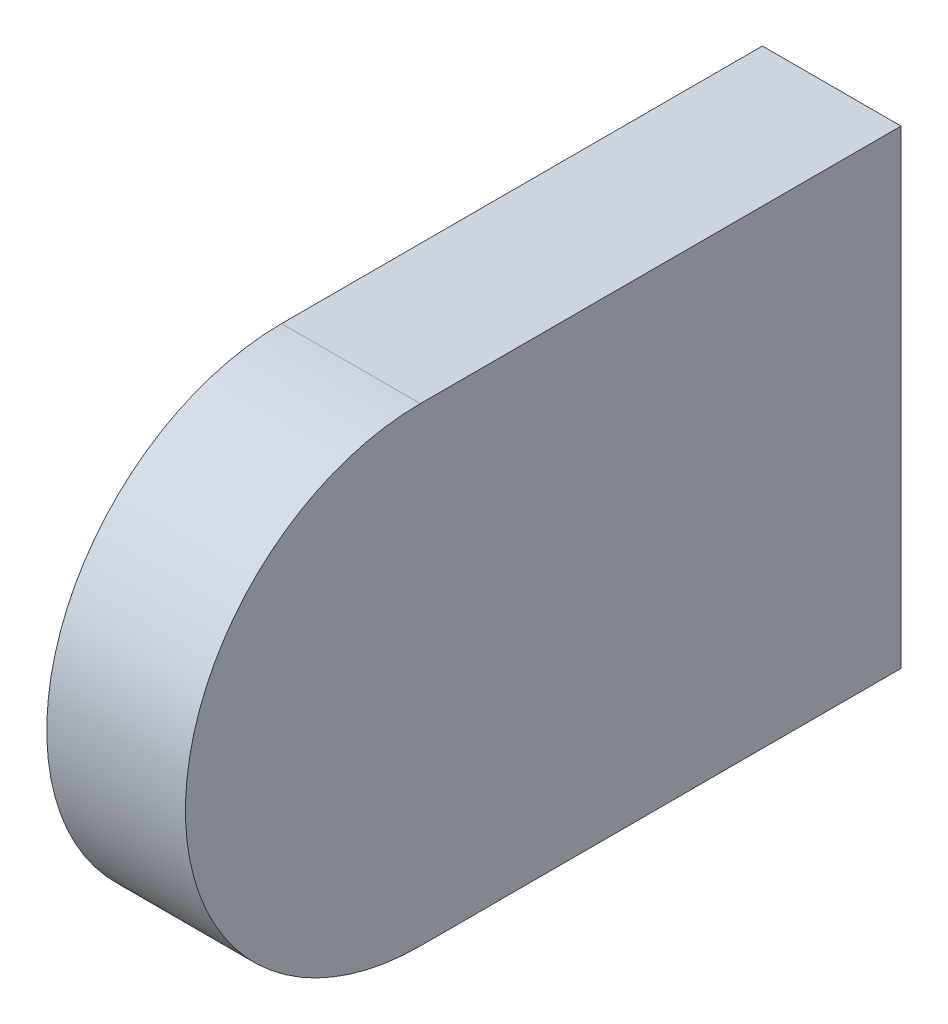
ISO-10303-21;
HEADER;
FILE_DESCRIPTION(('STEP AP214'),'2;1');
FILE_NAME('part.step','',(''),(''),'','','');
FILE_SCHEMA(('AUTOMOTIVE_DESIGN { 1 0 10303 214 1 1 1 1 }'));
ENDSEC;
DATA;
#1=APPLICATION_CONTEXT('core data for automotive mechanical design processes');
#2=APPLICATION_PROTOCOL_DEFINITION('international standard','automotive_design',2000,#1);
#3=PRODUCT_CONTEXT('',#1,'mechanical');
#4=PRODUCT('Part','Part','',(#3));
#5=PRODUCT_RELATED_PRODUCT_CATEGORY('part','',(#4));
#6=PRODUCT_DEFINITION_FORMATION('','',#4);
#7=PRODUCT_DEFINITION_CONTEXT('part definition',#1,'design');
#8=PRODUCT_DEFINITION('design','',#6,#7);
#9=PRODUCT_DEFINITION_SHAPE('','',#8);
#10=(LENGTH_UNIT() NAMED_UNIT(*) SI_UNIT(.MILLI.,.METRE.));
#11=(NAMED_UNIT(*) PLANE_ANGLE_UNIT() SI_UNIT($,.RADIAN.));
#12=(NAMED_UNIT(*) SI_UNIT($,.STERADIAN.) SOLID_ANGLE_UNIT());
#13=UNCERTAINTY_MEASURE_WITH_UNIT(LENGTH_MEASURE(1.E-05),#10,'distance_accuracy_value','');
#14=(GEOMETRIC_REPRESENTATION_CONTEXT(3) GLOBAL_UNCERTAINTY_ASSIGNED_CONTEXT((#13)) GLOBAL_UNIT_ASSIGNED_CONTEXT((#10,
#11,#12)) REPRESENTATION_CONTEXT('',''));
#15=CARTESIAN_POINT('',(0.,0.,0.));
#16=DIRECTION('',(0.,0.,1.));
#17=DIRECTION('',(1.,0.,0.));
#18=AXIS2_PLACEMENT_3D('',#15,#16,#17);
#19=CARTESIAN_POINT('',(75.,127.,0.));
#20=DIRECTION('',(0.,1.,0.));
#21=DIRECTION('',(0.,0.,1.));
#22=AXIS2_PLACEMENT_3D('',#19,#20,#21);
#23=PLANE('',#22);
#24=DIRECTION('',(0.,0.,-1.));
#25=VECTOR('',#24,1.);
#26=CARTESIAN_POINT('',(0.,127.,0.));
#27=LINE('',#26,#25);
#28=CARTESIAN_POINT('',(0.,127.,0.));
#29=VERTEX_POINT('',#28);
#30=CARTESIAN_POINT('',(0.,127.,-260.));
#31=VERTEX_POINT('',#30);
#32=EDGE_CURVE('E126',#29,#31,#27,.T.);
#33=ORIENTED_EDGE('',*,*,#32,.F.);
#34=DIRECTION('',(-1.,0.,0.));
#35=VECTOR('',#34,1.);
#36=CARTESIAN_POINT('',(75.,127.,0.));
#37=LINE('',#36,#35);
#38=CARTESIAN_POINT('',(75.,127.,0.));
#39=VERTEX_POINT('',#38);
#40=EDGE_CURVE('E11',#39,#29,#37,.T.);
#41=ORIENTED_EDGE('',*,*,#40,.F.);
#42=DIRECTION('',(0.,0.,-1.));
#43=VECTOR('',#42,1.);
#44=CARTESIAN_POINT('',(75.,127.,0.));
#45=LINE('',#44,#43);
#46=CARTESIAN_POINT('',(75.,127.,-260.));
#47=VERTEX_POINT('',#46);
#48=EDGE_CURVE('E118',#39,#47,#45,.T.);
#49=ORIENTED_EDGE('',*,*,#48,.T.);
#50=DIRECTION('',(-1.,0.,0.));
#51=VECTOR('',#50,1.);
#52=CARTESIAN_POINT('',(75.,127.,-260.));
#53=LINE('',#52,#51);
#54=EDGE_CURVE('E50',#47,#31,#53,.T.);
#55=ORIENTED_EDGE('',*,*,#54,.T.);
#56=EDGE_LOOP('',(#33,#41,#49,#55));
#57=FACE_BOUND('',#56,.T.);
#58=ADVANCED_FACE('F47',(#57),#23,.T.);
#59=CARTESIAN_POINT('',(75.,0.,0.));
#60=DIRECTION('',(-1.,0.,0.));
#61=DIRECTION('',(0.,0.,1.));
#62=AXIS2_PLACEMENT_3D('',#59,#60,#61);
#63=CYLINDRICAL_SURFACE('',#62,127.);
#64=CARTESIAN_POINT('',(0.,0.,0.));
#65=DIRECTION('',(1.,0.,0.));
#66=DIRECTION('',(0.,0.,-1.));
#67=AXIS2_PLACEMENT_3D('',#64,#65,#66);
#68=CIRCLE('',#67,127.);
#69=CARTESIAN_POINT('',(0.,-127.,0.));
#70=VERTEX_POINT('',#69);
#71=EDGE_CURVE('E86',#29,#70,#68,.T.);
#72=ORIENTED_EDGE('',*,*,#71,.T.);
#73=DIRECTION('',(-1.,0.,0.));
#74=VECTOR('',#73,1.);
#75=CARTESIAN_POINT('',(75.,-127.,0.));
#76=LINE('',#75,#74);
#77=CARTESIAN_POINT('',(75.,-127.,0.));
#78=VERTEX_POINT('',#77);
#79=EDGE_CURVE('E57',#78,#70,#76,.T.);
#80=ORIENTED_EDGE('',*,*,#79,.F.);
#81=CARTESIAN_POINT('',(75.,0.,0.));
#82=DIRECTION('',(1.,0.,0.));
#83=DIRECTION('',(0.,0.,-1.));
#84=AXIS2_PLACEMENT_3D('',#81,#82,#83);
#85=CIRCLE('',#84,127.);
#86=EDGE_CURVE('E103',#39,#78,#85,.T.);
#87=ORIENTED_EDGE('',*,*,#86,.F.);
#88=ORIENTED_EDGE('',*,*,#40,.T.);
#89=EDGE_LOOP('',(#72,#80,#87,#88));
#90=FACE_BOUND('',#89,.T.);
#91=ADVANCED_FACE('F140',(#90),#63,.T.);
#92=CARTESIAN_POINT('',(75.,-127.,0.));
#93=DIRECTION('',(0.,1.,0.));
#94=DIRECTION('',(0.,0.,1.));
#95=AXIS2_PLACEMENT_3D('',#92,#93,#94);
#96=PLANE('',#95);
#97=DIRECTION('',(0.,0.,-1.));
#98=VECTOR('',#97,1.);
#99=CARTESIAN_POINT('',(0.,-127.,0.));
#100=LINE('',#99,#98);
#101=CARTESIAN_POINT('',(0.,-127.,-260.));
#102=VERTEX_POINT('',#101);
#103=EDGE_CURVE('E111',#70,#102,#100,.T.);
#104=ORIENTED_EDGE('',*,*,#103,.T.);
#105=DIRECTION('',(-1.,0.,0.));
#106=VECTOR('',#105,1.);
#107=CARTESIAN_POINT('',(75.,-127.,-260.));
#108=LINE('',#107,#106);
#109=CARTESIAN_POINT('',(75.,-127.,-260.));
#110=VERTEX_POINT('',#109);
#111=EDGE_CURVE('E108',#110,#102,#108,.T.);
#112=ORIENTED_EDGE('',*,*,#111,.F.);
#113=DIRECTION('',(0.,0.,-1.));
#114=VECTOR('',#113,1.);
#115=CARTESIAN_POINT('',(75.,-127.,0.));
#116=LINE('',#115,#114);
#117=EDGE_CURVE('E100',#78,#110,#116,.T.);
#118=ORIENTED_EDGE('',*,*,#117,.F.);
#119=ORIENTED_EDGE('',*,*,#79,.T.);
#120=EDGE_LOOP('',(#104,#112,#118,#119));
#121=FACE_BOUND('',#120,.T.);
#122=ADVANCED_FACE('F109',(#121),#96,.F.);
#123=CARTESIAN_POINT('',(75.,-127.,-260.));
#124=DIRECTION('',(0.,0.,1.));
#125=DIRECTION('',(1.,0.,0.));
#126=AXIS2_PLACEMENT_3D('',#123,#124,#125);
#127=PLANE('',#126);
#128=DIRECTION('',(0.,1.,0.));
#129=VECTOR('',#128,1.);
#130=CARTESIAN_POINT('',(0.,-127.,-260.));
#131=LINE('',#130,#129);
#132=EDGE_CURVE('E130',#102,#31,#131,.T.);
#133=ORIENTED_EDGE('',*,*,#132,.T.);
#134=ORIENTED_EDGE('',*,*,#54,.F.);
#135=DIRECTION('',(0.,1.,0.));
#136=VECTOR('',#135,1.);
#137=CARTESIAN_POINT('',(75.,-127.,-260.));
#138=LINE('',#137,#136);
#139=EDGE_CURVE('E96',#110,#47,#138,.T.);
#140=ORIENTED_EDGE('',*,*,#139,.F.);
#141=ORIENTED_EDGE('',*,*,#111,.T.);
#142=EDGE_LOOP('',(#133,#134,#140,#141));
#143=FACE_BOUND('',#142,.T.);
#144=ADVANCED_FACE('F116',(#143),#127,.F.);
#145=CARTESIAN_POINT('',(75.,0.,0.));
#146=DIRECTION('',(1.,0.,0.));
#147=DIRECTION('',(0.,0.,-1.));
#148=AXIS2_PLACEMENT_3D('',#145,#146,#147);
#149=PLANE('',#148);
#150=ORIENTED_EDGE('',*,*,#48,.F.);
#151=ORIENTED_EDGE('',*,*,#86,.T.);
#152=ORIENTED_EDGE('',*,*,#117,.T.);
#153=ORIENTED_EDGE('',*,*,#139,.T.);
#154=EDGE_LOOP('',(#150,#151,#152,#153));
#155=FACE_BOUND('',#154,.T.);
#156=ADVANCED_FACE('F102',(#155),#149,.T.);
#157=CARTESIAN_POINT('',(0.,0.,0.));
#158=DIRECTION('',(1.,0.,0.));
#159=DIRECTION('',(0.,0.,-1.));
#160=AXIS2_PLACEMENT_3D('',#157,#158,#159);
#161=PLANE('',#160);
#162=ORIENTED_EDGE('',*,*,#32,.T.);
#163=ORIENTED_EDGE('',*,*,#132,.F.);
#164=ORIENTED_EDGE('',*,*,#103,.F.);
#165=ORIENTED_EDGE('',*,*,#71,.F.);
#166=EDGE_LOOP('',(#162,#163,#164,#165));
#167=FACE_BOUND('',#166,.T.);
#168=ADVANCED_FACE('F138',(#167),#161,.F.);
#169=CLOSED_SHELL('',(#58,#91,#122,#144,#156,#168));
#170=MANIFOLD_SOLID_BREP('B2',#169);
#171=ADVANCED_BREP_SHAPE_REPRESENTATION('',(#18,#170),#14);
#172=SHAPE_DEFINITION_REPRESENTATION(#9,#171);
ENDSEC;
END-ISO-10303-21;
